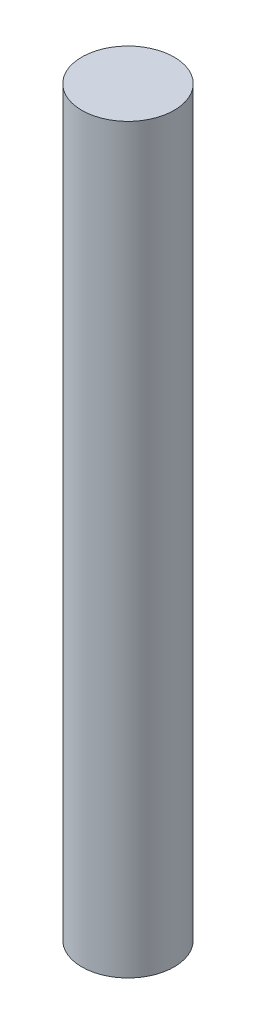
from build123d import *

# Parameters (mm, degrees)
CROQUIS1_R              = 28
SALIENTE_EXTRUIR1_DEPTH = 450
CROQUIS2_R              = 25
CORTAR_EXTRUIR1_DEPTH   = 5
CORTAR_EXTRUIR1_DRAFT   = -42


with BuildPart() as part:
    # Croquis1 → Saliente-Extruir1 (new body)
    with BuildSketch(Plane(origin=(0, 0, 0), x_dir=(1, 0, 0), z_dir=(0, 1, 0))):
        with Locations(Location((0, 0, 0), (0, 0, 270))):
            Circle(CROQUIS1_R)
    extrude(amount=SALIENTE_EXTRUIR1_DEPTH)


with BuildPart() as cortar_extruir1_tool:
    # Croquis2 → Cortar-Extruir1 (with draft: the straight prism first)
    with BuildSketch(Plane.XZ):
        Circle(CROQUIS2_R)
    extrude(amount=-CORTAR_EXTRUIR1_DEPTH)
    # Cortar-Extruir1: the draft: its side faces are tilted about the plane it starts from
    cortar_extruir1_sides = [cortar_extruir1_tool.faces().sort_by_distance(p)[0] for p in [
        (-25, 2.5, 0),
    ]]
    draft(cortar_extruir1_sides, Plane.XZ, CORTAR_EXTRUIR1_DRAFT)


with BuildPart() as part_1:
    add(part.part)

    # Cortar-Extruir1: cut by cortar_extruir1_tool
    add(cortar_extruir1_tool.part, mode=Mode.SUBTRACT)


solid = part_1.part
